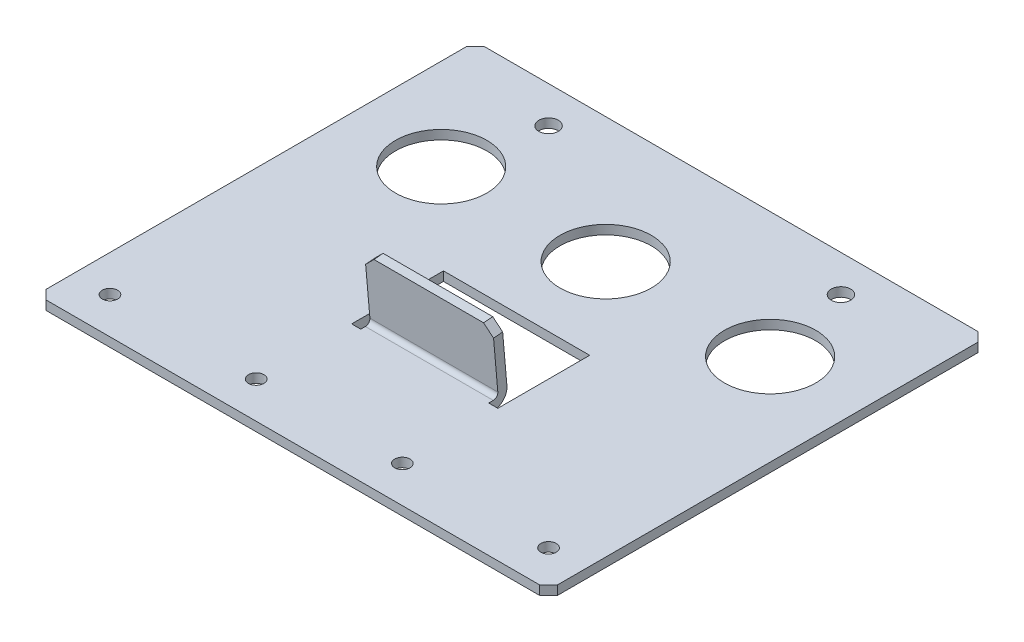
ISO-10303-21;
HEADER;
FILE_DESCRIPTION(('STEP AP214'),'2;1');
FILE_NAME('part.step','',(''),(''),'','','');
FILE_SCHEMA(('AUTOMOTIVE_DESIGN { 1 0 10303 214 1 1 1 1 }'));
ENDSEC;
DATA;
#1=APPLICATION_CONTEXT('core data for automotive mechanical design processes');
#2=APPLICATION_PROTOCOL_DEFINITION('international standard','automotive_design',2000,#1);
#3=PRODUCT_CONTEXT('',#1,'mechanical');
#4=PRODUCT('Part','Part','',(#3));
#5=PRODUCT_RELATED_PRODUCT_CATEGORY('part','',(#4));
#6=PRODUCT_DEFINITION_FORMATION('','',#4);
#7=PRODUCT_DEFINITION_CONTEXT('part definition',#1,'design');
#8=PRODUCT_DEFINITION('design','',#6,#7);
#9=PRODUCT_DEFINITION_SHAPE('','',#8);
#10=(LENGTH_UNIT() NAMED_UNIT(*) SI_UNIT(.MILLI.,.METRE.));
#11=(NAMED_UNIT(*) PLANE_ANGLE_UNIT() SI_UNIT($,.RADIAN.));
#12=(NAMED_UNIT(*) SI_UNIT($,.STERADIAN.) SOLID_ANGLE_UNIT());
#13=UNCERTAINTY_MEASURE_WITH_UNIT(LENGTH_MEASURE(1.E-05),#10,'distance_accuracy_value','');
#14=(GEOMETRIC_REPRESENTATION_CONTEXT(3) GLOBAL_UNCERTAINTY_ASSIGNED_CONTEXT((#13)) GLOBAL_UNIT_ASSIGNED_CONTEXT((#10,
#11,#12)) REPRESENTATION_CONTEXT('',''));
#15=CARTESIAN_POINT('',(0.,0.,0.));
#16=DIRECTION('',(0.,0.,1.));
#17=DIRECTION('',(1.,0.,0.));
#18=AXIS2_PLACEMENT_3D('',#15,#16,#17);
#19=CARTESIAN_POINT('',(0.,-3.175,0.));
#20=DIRECTION('',(0.,-1.,0.));
#21=DIRECTION('',(0.,0.,-1.));
#22=AXIS2_PLACEMENT_3D('',#19,#20,#21);
#23=PLANE('',#22);
#24=CARTESIAN_POINT('',(31.75,-3.175,-108.74375));
#25=DIRECTION('',(0.,1.,0.));
#26=DIRECTION('',(0.,0.,-1.));
#27=AXIS2_PLACEMENT_3D('',#24,#25,#26);
#28=CIRCLE('',#27,15.875);
#29=CARTESIAN_POINT('',(31.75,-3.175,-124.61875));
#30=VERTEX_POINT('',#29);
#31=EDGE_CURVE('E288',#30,#30,#28,.T.);
#32=ORIENTED_EDGE('',*,*,#31,.T.);
#33=EDGE_LOOP('',(#32));
#34=FACE_BOUND('',#33,.T.);
#35=CARTESIAN_POINT('',(146.05,-3.175,-108.74375));
#36=DIRECTION('',(0.,1.,0.));
#37=DIRECTION('',(0.,0.,1.));
#38=AXIS2_PLACEMENT_3D('',#35,#36,#37);
#39=CIRCLE('',#38,15.875);
#40=CARTESIAN_POINT('',(146.05,-3.175,-92.86875));
#41=VERTEX_POINT('',#40);
#42=EDGE_CURVE('E311',#41,#41,#39,.T.);
#43=ORIENTED_EDGE('',*,*,#42,.T.);
#44=EDGE_LOOP('',(#43));
#45=FACE_BOUND('',#44,.T.);
#46=CARTESIAN_POINT('',(88.9,-3.175,-108.74375));
#47=DIRECTION('',(0.,1.,0.));
#48=DIRECTION('',(0.,0.,1.));
#49=AXIS2_PLACEMENT_3D('',#46,#47,#48);
#50=CIRCLE('',#49,15.875);
#51=CARTESIAN_POINT('',(88.9,-3.175,-92.86875));
#52=VERTEX_POINT('',#51);
#53=EDGE_CURVE('E343',#52,#52,#50,.T.);
#54=ORIENTED_EDGE('',*,*,#53,.T.);
#55=EDGE_LOOP('',(#54));
#56=FACE_BOUND('',#55,.T.);
#57=DIRECTION('',(0.,0.,1.));
#58=VECTOR('',#57,1.);
#59=CARTESIAN_POINT('',(63.5,-3.175,0.));
#60=LINE('',#59,#58);
#61=CARTESIAN_POINT('',(63.5,-3.175,-77.7875));
#62=VERTEX_POINT('',#61);
#63=CARTESIAN_POINT('',(63.5,-3.175,-45.8804197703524));
#64=VERTEX_POINT('',#63);
#65=EDGE_CURVE('E423',#62,#64,#60,.T.);
#66=ORIENTED_EDGE('',*,*,#65,.T.);
#67=DIRECTION('',(1.,0.,0.));
#68=VECTOR('',#67,1.);
#69=CARTESIAN_POINT('',(0.,-3.175,-45.8804197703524));
#70=LINE('',#69,#68);
#71=CARTESIAN_POINT('',(66.675,-3.175,-45.8804197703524));
#72=VERTEX_POINT('',#71);
#73=EDGE_CURVE('E325',#64,#72,#70,.T.);
#74=ORIENTED_EDGE('',*,*,#73,.T.);
#75=DIRECTION('',(0.,0.,-1.));
#76=VECTOR('',#75,1.);
#77=CARTESIAN_POINT('',(66.675,-3.175,0.));
#78=LINE('',#77,#76);
#79=CARTESIAN_POINT('',(66.675,-3.175,-47.4679197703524));
#80=VERTEX_POINT('',#79);
#81=EDGE_CURVE('E484',#72,#80,#78,.T.);
#82=ORIENTED_EDGE('',*,*,#81,.T.);
#83=DIRECTION('',(1.,0.,0.));
#84=VECTOR('',#83,1.);
#85=CARTESIAN_POINT('',(66.675,-3.175,-47.4679197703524));
#86=LINE('',#85,#84);
#87=CARTESIAN_POINT('',(111.125,-3.175,-47.4679197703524));
#88=VERTEX_POINT('',#87);
#89=EDGE_CURVE('E431',#80,#88,#86,.T.);
#90=ORIENTED_EDGE('',*,*,#89,.T.);
#91=DIRECTION('',(0.,0.,1.));
#92=VECTOR('',#91,1.);
#93=CARTESIAN_POINT('',(111.125,-3.175,0.));
#94=LINE('',#93,#92);
#95=CARTESIAN_POINT('',(111.125,-3.175,-45.8804197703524));
#96=VERTEX_POINT('',#95);
#97=EDGE_CURVE('E469',#88,#96,#94,.T.);
#98=ORIENTED_EDGE('',*,*,#97,.T.);
#99=DIRECTION('',(1.,0.,0.));
#100=VECTOR('',#99,1.);
#101=CARTESIAN_POINT('',(0.,-3.175,-45.8804197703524));
#102=LINE('',#101,#100);
#103=CARTESIAN_POINT('',(114.3,-3.175,-45.8804197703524));
#104=VERTEX_POINT('',#103);
#105=EDGE_CURVE('E446',#96,#104,#102,.T.);
#106=ORIENTED_EDGE('',*,*,#105,.T.);
#107=DIRECTION('',(0.,0.,1.));
#108=VECTOR('',#107,1.);
#109=CARTESIAN_POINT('',(114.3,-3.175,0.));
#110=LINE('',#109,#108);
#111=CARTESIAN_POINT('',(114.3,-3.175,-77.7875));
#112=VERTEX_POINT('',#111);
#113=EDGE_CURVE('E509',#112,#104,#110,.T.);
#114=ORIENTED_EDGE('',*,*,#113,.F.);
#115=DIRECTION('',(1.,0.,0.));
#116=VECTOR('',#115,1.);
#117=CARTESIAN_POINT('',(0.,-3.175,-77.7875));
#118=LINE('',#117,#116);
#119=EDGE_CURVE('E315',#62,#112,#118,.T.);
#120=ORIENTED_EDGE('',*,*,#119,.F.);
#121=EDGE_LOOP('',(#66,#74,#82,#90,#98,#106,#114,#120));
#122=FACE_BOUND('',#121,.T.);
#123=CARTESIAN_POINT('',(114.3,-3.175,-12.7));
#124=DIRECTION('',(0.,1.,0.));
#125=DIRECTION('',(0.,0.,-1.));
#126=AXIS2_PLACEMENT_3D('',#123,#124,#125);
#127=CIRCLE('',#126,2.667);
#128=CARTESIAN_POINT('',(114.3,-3.175,-15.367));
#129=VERTEX_POINT('',#128);
#130=EDGE_CURVE('E396',#129,#129,#127,.T.);
#131=ORIENTED_EDGE('',*,*,#130,.T.);
#132=EDGE_LOOP('',(#131));
#133=FACE_BOUND('',#132,.T.);
#134=CARTESIAN_POINT('',(63.5,-3.175,-12.7));
#135=DIRECTION('',(0.,1.,0.));
#136=DIRECTION('',(0.,0.,1.));
#137=AXIS2_PLACEMENT_3D('',#134,#135,#136);
#138=CIRCLE('',#137,2.667);
#139=CARTESIAN_POINT('',(63.5,-3.175,-10.033));
#140=VERTEX_POINT('',#139);
#141=EDGE_CURVE('E395',#140,#140,#138,.T.);
#142=ORIENTED_EDGE('',*,*,#141,.T.);
#143=EDGE_LOOP('',(#142));
#144=FACE_BOUND('',#143,.T.);
#145=CARTESIAN_POINT('',(165.1,-3.175,-12.7));
#146=DIRECTION('',(0.,1.,0.));
#147=DIRECTION('',(0.,0.,-1.));
#148=AXIS2_PLACEMENT_3D('',#145,#146,#147);
#149=CIRCLE('',#148,2.667);
#150=CARTESIAN_POINT('',(165.1,-3.175,-15.367));
#151=VERTEX_POINT('',#150);
#152=EDGE_CURVE('E560',#151,#151,#149,.T.);
#153=ORIENTED_EDGE('',*,*,#152,.T.);
#154=EDGE_LOOP('',(#153));
#155=FACE_BOUND('',#154,.T.);
#156=CARTESIAN_POINT('',(12.7,-3.175,-12.7));
#157=DIRECTION('',(0.,1.,0.));
#158=DIRECTION('',(0.,0.,1.));
#159=AXIS2_PLACEMENT_3D('',#156,#157,#158);
#160=CIRCLE('',#159,2.667);
#161=CARTESIAN_POINT('',(12.7,-3.175,-10.033));
#162=VERTEX_POINT('',#161);
#163=EDGE_CURVE('E304',#162,#162,#160,.T.);
#164=ORIENTED_EDGE('',*,*,#163,.T.);
#165=EDGE_LOOP('',(#164));
#166=FACE_BOUND('',#165,.T.);
#167=CARTESIAN_POINT('',(139.7,-3.175,-139.7));
#168=DIRECTION('',(0.,1.,0.));
#169=DIRECTION('',(0.,0.,-1.));
#170=AXIS2_PLACEMENT_3D('',#167,#168,#169);
#171=CIRCLE('',#170,3.3782);
#172=CARTESIAN_POINT('',(139.7,-3.175,-143.0782));
#173=VERTEX_POINT('',#172);
#174=EDGE_CURVE('E303',#173,#173,#171,.T.);
#175=ORIENTED_EDGE('',*,*,#174,.T.);
#176=EDGE_LOOP('',(#175));
#177=FACE_BOUND('',#176,.T.);
#178=CARTESIAN_POINT('',(38.1,-3.175,-139.7));
#179=DIRECTION('',(0.,1.,0.));
#180=DIRECTION('',(0.,0.,1.));
#181=AXIS2_PLACEMENT_3D('',#178,#179,#180);
#182=CIRCLE('',#181,3.3782);
#183=CARTESIAN_POINT('',(38.1,-3.175,-136.3218));
#184=VERTEX_POINT('',#183);
#185=EDGE_CURVE('E35',#184,#184,#182,.T.);
#186=ORIENTED_EDGE('',*,*,#185,.T.);
#187=EDGE_LOOP('',(#186));
#188=FACE_BOUND('',#187,.T.);
#189=DIRECTION('',(0.,0.,1.));
#190=VECTOR('',#189,1.);
#191=CARTESIAN_POINT('',(0.,-3.175,0.));
#192=LINE('',#191,#190);
#193=CARTESIAN_POINT('',(0.,-3.175,-149.225));
#194=VERTEX_POINT('',#193);
#195=CARTESIAN_POINT('',(0.,-3.175,-3.175));
#196=VERTEX_POINT('',#195);
#197=EDGE_CURVE('E11',#194,#196,#192,.T.);
#198=ORIENTED_EDGE('',*,*,#197,.F.);
#199=DIRECTION('',(0.707106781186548,0.,-0.707106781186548));
#200=VECTOR('',#199,1.);
#201=CARTESIAN_POINT('',(-74.6125,-3.175,-74.6125));
#202=LINE('',#201,#200);
#203=CARTESIAN_POINT('',(3.175,-3.175,-152.4));
#204=VERTEX_POINT('',#203);
#205=EDGE_CURVE('E401',#194,#204,#202,.T.);
#206=ORIENTED_EDGE('',*,*,#205,.T.);
#207=DIRECTION('',(-1.,0.,0.));
#208=VECTOR('',#207,1.);
#209=CARTESIAN_POINT('',(0.,-3.175,-152.4));
#210=LINE('',#209,#208);
#211=CARTESIAN_POINT('',(174.625,-3.175,-152.4));
#212=VERTEX_POINT('',#211);
#213=EDGE_CURVE('E327',#212,#204,#210,.T.);
#214=ORIENTED_EDGE('',*,*,#213,.F.);
#215=DIRECTION('',(0.707106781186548,0.,0.707106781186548));
#216=VECTOR('',#215,1.);
#217=CARTESIAN_POINT('',(163.5125,-3.175,-163.5125));
#218=LINE('',#217,#216);
#219=CARTESIAN_POINT('',(177.8,-3.175,-149.225));
#220=VERTEX_POINT('',#219);
#221=EDGE_CURVE('E533',#212,#220,#218,.T.);
#222=ORIENTED_EDGE('',*,*,#221,.T.);
#223=DIRECTION('',(0.,0.,-1.));
#224=VECTOR('',#223,1.);
#225=CARTESIAN_POINT('',(177.8,-3.175,0.));
#226=LINE('',#225,#224);
#227=CARTESIAN_POINT('',(177.8,-3.175,-3.175));
#228=VERTEX_POINT('',#227);
#229=EDGE_CURVE('E296',#228,#220,#226,.T.);
#230=ORIENTED_EDGE('',*,*,#229,.F.);
#231=DIRECTION('',(-0.707106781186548,0.,0.707106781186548));
#232=VECTOR('',#231,1.);
#233=CARTESIAN_POINT('',(87.3125,-3.175,87.3125));
#234=LINE('',#233,#232);
#235=CARTESIAN_POINT('',(174.625,-3.175,0.));
#236=VERTEX_POINT('',#235);
#237=EDGE_CURVE('E417',#228,#236,#234,.T.);
#238=ORIENTED_EDGE('',*,*,#237,.T.);
#239=DIRECTION('',(1.,0.,0.));
#240=VECTOR('',#239,1.);
#241=CARTESIAN_POINT('',(0.,-3.175,0.));
#242=LINE('',#241,#240);
#243=CARTESIAN_POINT('',(3.175,-3.175,0.));
#244=VERTEX_POINT('',#243);
#245=EDGE_CURVE('E481',#244,#236,#242,.T.);
#246=ORIENTED_EDGE('',*,*,#245,.F.);
#247=DIRECTION('',(-0.707106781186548,0.,-0.707106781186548));
#248=VECTOR('',#247,1.);
#249=CARTESIAN_POINT('',(1.5875,-3.175,-1.5875));
#250=LINE('',#249,#248);
#251=EDGE_CURVE('E512',#244,#196,#250,.T.);
#252=ORIENTED_EDGE('',*,*,#251,.T.);
#253=EDGE_LOOP('',(#198,#206,#214,#222,#230,#238,#246,#252));
#254=FACE_BOUND('',#253,.T.);
#255=ADVANCED_FACE('F17',(#34,#45,#56,#122,#133,#144,#155,#166,#177,#188,#254),#23,.T.);
#256=CARTESIAN_POINT('',(0.,0.,0.));
#257=DIRECTION('',(0.,-1.,0.));
#258=DIRECTION('',(0.,0.,-1.));
#259=AXIS2_PLACEMENT_3D('',#256,#257,#258);
#260=PLANE('',#259);
#261=CARTESIAN_POINT('',(31.75,0.,-108.74375));
#262=DIRECTION('',(0.,1.,0.));
#263=DIRECTION('',(0.,0.,-1.));
#264=AXIS2_PLACEMENT_3D('',#261,#262,#263);
#265=CIRCLE('',#264,15.875);
#266=CARTESIAN_POINT('',(31.75,0.,-124.61875));
#267=VERTEX_POINT('',#266);
#268=EDGE_CURVE('E284',#267,#267,#265,.T.);
#269=ORIENTED_EDGE('',*,*,#268,.F.);
#270=EDGE_LOOP('',(#269));
#271=FACE_BOUND('',#270,.T.);
#272=CARTESIAN_POINT('',(146.05,0.,-108.74375));
#273=DIRECTION('',(0.,1.,0.));
#274=DIRECTION('',(0.,0.,1.));
#275=AXIS2_PLACEMENT_3D('',#272,#273,#274);
#276=CIRCLE('',#275,15.875);
#277=CARTESIAN_POINT('',(146.05,0.,-92.86875));
#278=VERTEX_POINT('',#277);
#279=EDGE_CURVE('E293',#278,#278,#276,.T.);
#280=ORIENTED_EDGE('',*,*,#279,.F.);
#281=EDGE_LOOP('',(#280));
#282=FACE_BOUND('',#281,.T.);
#283=CARTESIAN_POINT('',(88.9,0.,-108.74375));
#284=DIRECTION('',(0.,1.,0.));
#285=DIRECTION('',(0.,0.,1.));
#286=AXIS2_PLACEMENT_3D('',#283,#284,#285);
#287=CIRCLE('',#286,15.875);
#288=CARTESIAN_POINT('',(88.9,0.,-92.86875));
#289=VERTEX_POINT('',#288);
#290=EDGE_CURVE('E314',#289,#289,#287,.T.);
#291=ORIENTED_EDGE('',*,*,#290,.F.);
#292=EDGE_LOOP('',(#291));
#293=FACE_BOUND('',#292,.T.);
#294=CARTESIAN_POINT('',(114.3,0.,-12.7));
#295=DIRECTION('',(0.,1.,0.));
#296=DIRECTION('',(0.,0.,-1.));
#297=AXIS2_PLACEMENT_3D('',#294,#295,#296);
#298=CIRCLE('',#297,2.667);
#299=CARTESIAN_POINT('',(114.3,0.,-15.367));
#300=VERTEX_POINT('',#299);
#301=EDGE_CURVE('E474',#300,#300,#298,.T.);
#302=ORIENTED_EDGE('',*,*,#301,.F.);
#303=EDGE_LOOP('',(#302));
#304=FACE_BOUND('',#303,.T.);
#305=CARTESIAN_POINT('',(63.5,0.,-12.7));
#306=DIRECTION('',(0.,1.,0.));
#307=DIRECTION('',(0.,0.,1.));
#308=AXIS2_PLACEMENT_3D('',#305,#306,#307);
#309=CIRCLE('',#308,2.667);
#310=CARTESIAN_POINT('',(63.5,0.,-10.033));
#311=VERTEX_POINT('',#310);
#312=EDGE_CURVE('E392',#311,#311,#309,.T.);
#313=ORIENTED_EDGE('',*,*,#312,.F.);
#314=EDGE_LOOP('',(#313));
#315=FACE_BOUND('',#314,.T.);
#316=CARTESIAN_POINT('',(165.1,0.,-12.7));
#317=DIRECTION('',(0.,1.,0.));
#318=DIRECTION('',(0.,0.,-1.));
#319=AXIS2_PLACEMENT_3D('',#316,#317,#318);
#320=CIRCLE('',#319,2.667);
#321=CARTESIAN_POINT('',(165.1,0.,-15.367));
#322=VERTEX_POINT('',#321);
#323=EDGE_CURVE('E489',#322,#322,#320,.T.);
#324=ORIENTED_EDGE('',*,*,#323,.F.);
#325=EDGE_LOOP('',(#324));
#326=FACE_BOUND('',#325,.T.);
#327=CARTESIAN_POINT('',(12.7,0.,-12.7));
#328=DIRECTION('',(0.,1.,0.));
#329=DIRECTION('',(0.,0.,1.));
#330=AXIS2_PLACEMENT_3D('',#327,#328,#329);
#331=CIRCLE('',#330,2.667);
#332=CARTESIAN_POINT('',(12.7,0.,-10.033));
#333=VERTEX_POINT('',#332);
#334=EDGE_CURVE('E563',#333,#333,#331,.T.);
#335=ORIENTED_EDGE('',*,*,#334,.F.);
#336=EDGE_LOOP('',(#335));
#337=FACE_BOUND('',#336,.T.);
#338=CARTESIAN_POINT('',(139.7,0.,-139.7));
#339=DIRECTION('',(0.,1.,0.));
#340=DIRECTION('',(0.,0.,-1.));
#341=AXIS2_PLACEMENT_3D('',#338,#339,#340);
#342=CIRCLE('',#341,3.3782);
#343=CARTESIAN_POINT('',(139.7,0.,-143.0782));
#344=VERTEX_POINT('',#343);
#345=EDGE_CURVE('E300',#344,#344,#342,.T.);
#346=ORIENTED_EDGE('',*,*,#345,.F.);
#347=EDGE_LOOP('',(#346));
#348=FACE_BOUND('',#347,.T.);
#349=CARTESIAN_POINT('',(38.1,0.,-139.7));
#350=DIRECTION('',(0.,1.,0.));
#351=DIRECTION('',(0.,0.,1.));
#352=AXIS2_PLACEMENT_3D('',#349,#350,#351);
#353=CIRCLE('',#352,3.3782);
#354=CARTESIAN_POINT('',(38.1,0.,-136.3218));
#355=VERTEX_POINT('',#354);
#356=EDGE_CURVE('E42',#355,#355,#353,.T.);
#357=ORIENTED_EDGE('',*,*,#356,.F.);
#358=EDGE_LOOP('',(#357));
#359=FACE_BOUND('',#358,.T.);
#360=DIRECTION('',(-1.,0.,0.));
#361=VECTOR('',#360,1.);
#362=CARTESIAN_POINT('',(0.,0.,-152.4));
#363=LINE('',#362,#361);
#364=CARTESIAN_POINT('',(174.625,0.,-152.4));
#365=VERTEX_POINT('',#364);
#366=CARTESIAN_POINT('',(3.175,0.,-152.4));
#367=VERTEX_POINT('',#366);
#368=EDGE_CURVE('E330',#365,#367,#363,.T.);
#369=ORIENTED_EDGE('',*,*,#368,.T.);
#370=DIRECTION('',(-0.707106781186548,0.,0.707106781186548));
#371=VECTOR('',#370,1.);
#372=CARTESIAN_POINT('',(3.175,0.,-152.4));
#373=LINE('',#372,#371);
#374=CARTESIAN_POINT('',(0.,0.,-149.225));
#375=VERTEX_POINT('',#374);
#376=EDGE_CURVE('E475',#367,#375,#373,.T.);
#377=ORIENTED_EDGE('',*,*,#376,.T.);
#378=DIRECTION('',(0.,0.,1.));
#379=VECTOR('',#378,1.);
#380=CARTESIAN_POINT('',(0.,0.,0.));
#381=LINE('',#380,#379);
#382=CARTESIAN_POINT('',(0.,0.,-3.175));
#383=VERTEX_POINT('',#382);
#384=EDGE_CURVE('E25',#375,#383,#381,.T.);
#385=ORIENTED_EDGE('',*,*,#384,.T.);
#386=DIRECTION('',(0.707106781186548,0.,0.707106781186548));
#387=VECTOR('',#386,1.);
#388=CARTESIAN_POINT('',(0.,0.,-3.175));
#389=LINE('',#388,#387);
#390=CARTESIAN_POINT('',(3.175,0.,0.));
#391=VERTEX_POINT('',#390);
#392=EDGE_CURVE('E451',#383,#391,#389,.T.);
#393=ORIENTED_EDGE('',*,*,#392,.T.);
#394=DIRECTION('',(1.,0.,0.));
#395=VECTOR('',#394,1.);
#396=CARTESIAN_POINT('',(0.,0.,0.));
#397=LINE('',#396,#395);
#398=CARTESIAN_POINT('',(174.625,0.,0.));
#399=VERTEX_POINT('',#398);
#400=EDGE_CURVE('E299',#391,#399,#397,.T.);
#401=ORIENTED_EDGE('',*,*,#400,.T.);
#402=DIRECTION('',(0.707106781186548,0.,-0.707106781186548));
#403=VECTOR('',#402,1.);
#404=CARTESIAN_POINT('',(174.625,0.,0.));
#405=LINE('',#404,#403);
#406=CARTESIAN_POINT('',(177.8,0.,-3.175));
#407=VERTEX_POINT('',#406);
#408=EDGE_CURVE('E443',#399,#407,#405,.T.);
#409=ORIENTED_EDGE('',*,*,#408,.T.);
#410=DIRECTION('',(0.,0.,-1.));
#411=VECTOR('',#410,1.);
#412=CARTESIAN_POINT('',(177.8,0.,0.));
#413=LINE('',#412,#411);
#414=CARTESIAN_POINT('',(177.8,0.,-149.225));
#415=VERTEX_POINT('',#414);
#416=EDGE_CURVE('E298',#407,#415,#413,.T.);
#417=ORIENTED_EDGE('',*,*,#416,.T.);
#418=DIRECTION('',(-0.707106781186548,0.,-0.707106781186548));
#419=VECTOR('',#418,1.);
#420=CARTESIAN_POINT('',(177.8,0.,-149.225));
#421=LINE('',#420,#419);
#422=EDGE_CURVE('E541',#415,#365,#421,.T.);
#423=ORIENTED_EDGE('',*,*,#422,.T.);
#424=EDGE_LOOP('',(#369,#377,#385,#393,#401,#409,#417,#423));
#425=FACE_BOUND('',#424,.T.);
#426=DIRECTION('',(1.,0.,0.));
#427=VECTOR('',#426,1.);
#428=CARTESIAN_POINT('',(65.0875,0.,-45.8804197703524));
#429=LINE('',#428,#427);
#430=CARTESIAN_POINT('',(63.5,0.,-45.8804197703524));
#431=VERTEX_POINT('',#430);
#432=CARTESIAN_POINT('',(66.675,0.,-45.8804197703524));
#433=VERTEX_POINT('',#432);
#434=EDGE_CURVE('E324',#431,#433,#429,.T.);
#435=ORIENTED_EDGE('',*,*,#434,.F.);
#436=DIRECTION('',(0.,0.,1.));
#437=VECTOR('',#436,1.);
#438=CARTESIAN_POINT('',(63.5,0.,0.));
#439=LINE('',#438,#437);
#440=CARTESIAN_POINT('',(63.5,0.,-77.7875));
#441=VERTEX_POINT('',#440);
#442=EDGE_CURVE('E427',#441,#431,#439,.T.);
#443=ORIENTED_EDGE('',*,*,#442,.F.);
#444=DIRECTION('',(1.,0.,0.));
#445=VECTOR('',#444,1.);
#446=CARTESIAN_POINT('',(0.,0.,-77.7875));
#447=LINE('',#446,#445);
#448=CARTESIAN_POINT('',(114.3,0.,-77.7875));
#449=VERTEX_POINT('',#448);
#450=EDGE_CURVE('E497',#441,#449,#447,.T.);
#451=ORIENTED_EDGE('',*,*,#450,.T.);
#452=DIRECTION('',(0.,0.,1.));
#453=VECTOR('',#452,1.);
#454=CARTESIAN_POINT('',(114.3,0.,0.));
#455=LINE('',#454,#453);
#456=CARTESIAN_POINT('',(114.3,0.,-45.8804197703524));
#457=VERTEX_POINT('',#456);
#458=EDGE_CURVE('E426',#449,#457,#455,.T.);
#459=ORIENTED_EDGE('',*,*,#458,.T.);
#460=DIRECTION('',(1.,0.,0.));
#461=VECTOR('',#460,1.);
#462=CARTESIAN_POINT('',(111.125,0.,-45.8804197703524));
#463=LINE('',#462,#461);
#464=CARTESIAN_POINT('',(111.125,0.,-45.8804197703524));
#465=VERTEX_POINT('',#464);
#466=EDGE_CURVE('E459',#465,#457,#463,.T.);
#467=ORIENTED_EDGE('',*,*,#466,.F.);
#468=DIRECTION('',(0.,0.,1.));
#469=VECTOR('',#468,1.);
#470=CARTESIAN_POINT('',(111.125,0.,-47.4679197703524));
#471=LINE('',#470,#469);
#472=CARTESIAN_POINT('',(111.125,0.,-47.4679197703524));
#473=VERTEX_POINT('',#472);
#474=EDGE_CURVE('E478',#473,#465,#471,.T.);
#475=ORIENTED_EDGE('',*,*,#474,.F.);
#476=DIRECTION('',(1.,0.,0.));
#477=VECTOR('',#476,1.);
#478=CARTESIAN_POINT('',(66.675,0.,-47.4679197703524));
#479=LINE('',#478,#477);
#480=CARTESIAN_POINT('',(66.675,0.,-47.4679197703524));
#481=VERTEX_POINT('',#480);
#482=EDGE_CURVE('E409',#481,#473,#479,.T.);
#483=ORIENTED_EDGE('',*,*,#482,.F.);
#484=DIRECTION('',(0.,0.,-1.));
#485=VECTOR('',#484,1.);
#486=CARTESIAN_POINT('',(66.675,0.,-45.8804197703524));
#487=LINE('',#486,#485);
#488=EDGE_CURVE('E346',#433,#481,#487,.T.);
#489=ORIENTED_EDGE('',*,*,#488,.F.);
#490=EDGE_LOOP('',(#435,#443,#451,#459,#467,#475,#483,#489));
#491=FACE_BOUND('',#490,.T.);
#492=ADVANCED_FACE('F576',(#271,#282,#293,#304,#315,#326,#337,#348,#359,#425,#491),#260,.F.);
#493=CARTESIAN_POINT('',(0.,-3.175,0.));
#494=DIRECTION('',(-1.,0.,0.));
#495=DIRECTION('',(0.,0.,1.));
#496=AXIS2_PLACEMENT_3D('',#493,#494,#495);
#497=PLANE('',#496);
#498=ORIENTED_EDGE('',*,*,#384,.F.);
#499=DIRECTION('',(0.,-1.,0.));
#500=VECTOR('',#499,1.);
#501=CARTESIAN_POINT('',(0.,-3.175,-149.225));
#502=LINE('',#501,#500);
#503=EDGE_CURVE('E405',#375,#194,#502,.T.);
#504=ORIENTED_EDGE('',*,*,#503,.T.);
#505=ORIENTED_EDGE('',*,*,#197,.T.);
#506=DIRECTION('',(0.,1.,0.));
#507=VECTOR('',#506,1.);
#508=CARTESIAN_POINT('',(0.,-3.175,-3.175));
#509=LINE('',#508,#507);
#510=EDGE_CURVE('E422',#196,#383,#509,.T.);
#511=ORIENTED_EDGE('',*,*,#510,.T.);
#512=EDGE_LOOP('',(#498,#504,#505,#511));
#513=FACE_BOUND('',#512,.T.);
#514=ADVANCED_FACE('F584',(#513),#497,.T.);
#515=CARTESIAN_POINT('',(0.,-3.175,-152.4));
#516=DIRECTION('',(0.,0.,-1.));
#517=DIRECTION('',(0.,-1.,0.));
#518=AXIS2_PLACEMENT_3D('',#515,#516,#517);
#519=PLANE('',#518);
#520=ORIENTED_EDGE('',*,*,#213,.T.);
#521=DIRECTION('',(0.,1.,0.));
#522=VECTOR('',#521,1.);
#523=CARTESIAN_POINT('',(3.175,-3.175,-152.4));
#524=LINE('',#523,#522);
#525=EDGE_CURVE('E470',#204,#367,#524,.T.);
#526=ORIENTED_EDGE('',*,*,#525,.T.);
#527=ORIENTED_EDGE('',*,*,#368,.F.);
#528=DIRECTION('',(0.,-1.,0.));
#529=VECTOR('',#528,1.);
#530=CARTESIAN_POINT('',(174.625,-3.175,-152.4));
#531=LINE('',#530,#529);
#532=EDGE_CURVE('E537',#365,#212,#531,.T.);
#533=ORIENTED_EDGE('',*,*,#532,.T.);
#534=EDGE_LOOP('',(#520,#526,#527,#533));
#535=FACE_BOUND('',#534,.T.);
#536=ADVANCED_FACE('F606',(#535),#519,.T.);
#537=CARTESIAN_POINT('',(177.8,-3.175,0.));
#538=DIRECTION('',(1.,0.,0.));
#539=DIRECTION('',(0.,1.,0.));
#540=AXIS2_PLACEMENT_3D('',#537,#538,#539);
#541=PLANE('',#540);
#542=ORIENTED_EDGE('',*,*,#229,.T.);
#543=DIRECTION('',(0.,1.,0.));
#544=VECTOR('',#543,1.);
#545=CARTESIAN_POINT('',(177.8,-3.175,-149.225));
#546=LINE('',#545,#544);
#547=EDGE_CURVE('E406',#220,#415,#546,.T.);
#548=ORIENTED_EDGE('',*,*,#547,.T.);
#549=ORIENTED_EDGE('',*,*,#416,.F.);
#550=DIRECTION('',(0.,-1.,0.));
#551=VECTOR('',#550,1.);
#552=CARTESIAN_POINT('',(177.8,-3.175,-3.175));
#553=LINE('',#552,#551);
#554=EDGE_CURVE('E421',#407,#228,#553,.T.);
#555=ORIENTED_EDGE('',*,*,#554,.T.);
#556=EDGE_LOOP('',(#542,#548,#549,#555));
#557=FACE_BOUND('',#556,.T.);
#558=ADVANCED_FACE('F597',(#557),#541,.T.);
#559=CARTESIAN_POINT('',(0.,-3.175,0.));
#560=DIRECTION('',(0.,0.,1.));
#561=DIRECTION('',(1.,0.,0.));
#562=AXIS2_PLACEMENT_3D('',#559,#560,#561);
#563=PLANE('',#562);
#564=ORIENTED_EDGE('',*,*,#245,.T.);
#565=DIRECTION('',(0.,1.,0.));
#566=VECTOR('',#565,1.);
#567=CARTESIAN_POINT('',(174.625,-3.175,0.));
#568=LINE('',#567,#566);
#569=EDGE_CURVE('E529',#236,#399,#568,.T.);
#570=ORIENTED_EDGE('',*,*,#569,.T.);
#571=ORIENTED_EDGE('',*,*,#400,.F.);
#572=DIRECTION('',(0.,-1.,0.));
#573=VECTOR('',#572,1.);
#574=CARTESIAN_POINT('',(3.175,-3.175,0.));
#575=LINE('',#574,#573);
#576=EDGE_CURVE('E455',#391,#244,#575,.T.);
#577=ORIENTED_EDGE('',*,*,#576,.T.);
#578=EDGE_LOOP('',(#564,#570,#571,#577));
#579=FACE_BOUND('',#578,.T.);
#580=ADVANCED_FACE('F589',(#579),#563,.T.);
#581=CARTESIAN_POINT('',(38.1,-3.175,-139.7));
#582=DIRECTION('',(0.,1.,0.));
#583=DIRECTION('',(0.,0.,1.));
#584=AXIS2_PLACEMENT_3D('',#581,#582,#583);
#585=CYLINDRICAL_SURFACE('',#584,3.3782);
#586=ORIENTED_EDGE('',*,*,#185,.F.);
#587=EDGE_LOOP('',(#586));
#588=FACE_BOUND('',#587,.T.);
#589=ORIENTED_EDGE('',*,*,#356,.T.);
#590=EDGE_LOOP('',(#589));
#591=FACE_BOUND('',#590,.T.);
#592=ADVANCED_FACE('F642',(#588,#591),#585,.F.);
#593=CARTESIAN_POINT('',(139.7,-3.175,-139.7));
#594=DIRECTION('',(0.,1.,0.));
#595=DIRECTION('',(0.,0.,1.));
#596=AXIS2_PLACEMENT_3D('',#593,#594,#595);
#597=CYLINDRICAL_SURFACE('',#596,3.3782);
#598=ORIENTED_EDGE('',*,*,#174,.F.);
#599=EDGE_LOOP('',(#598));
#600=FACE_BOUND('',#599,.T.);
#601=ORIENTED_EDGE('',*,*,#345,.T.);
#602=EDGE_LOOP('',(#601));
#603=FACE_BOUND('',#602,.T.);
#604=ADVANCED_FACE('F638',(#600,#603),#597,.F.);
#605=CARTESIAN_POINT('',(12.7,-3.175,-12.7));
#606=DIRECTION('',(0.,1.,0.));
#607=DIRECTION('',(0.,0.,1.));
#608=AXIS2_PLACEMENT_3D('',#605,#606,#607);
#609=CYLINDRICAL_SURFACE('',#608,2.667);
#610=ORIENTED_EDGE('',*,*,#163,.F.);
#611=EDGE_LOOP('',(#610));
#612=FACE_BOUND('',#611,.T.);
#613=ORIENTED_EDGE('',*,*,#334,.T.);
#614=EDGE_LOOP('',(#613));
#615=FACE_BOUND('',#614,.T.);
#616=ADVANCED_FACE('F641',(#612,#615),#609,.F.);
#617=CARTESIAN_POINT('',(165.1,-3.175,-12.7));
#618=DIRECTION('',(0.,1.,0.));
#619=DIRECTION('',(0.,0.,1.));
#620=AXIS2_PLACEMENT_3D('',#617,#618,#619);
#621=CYLINDRICAL_SURFACE('',#620,2.667);
#622=ORIENTED_EDGE('',*,*,#152,.F.);
#623=EDGE_LOOP('',(#622));
#624=FACE_BOUND('',#623,.T.);
#625=ORIENTED_EDGE('',*,*,#323,.T.);
#626=EDGE_LOOP('',(#625));
#627=FACE_BOUND('',#626,.T.);
#628=ADVANCED_FACE('F652',(#624,#627),#621,.F.);
#629=CARTESIAN_POINT('',(63.5,-3.175,-12.7));
#630=DIRECTION('',(0.,1.,0.));
#631=DIRECTION('',(0.,0.,1.));
#632=AXIS2_PLACEMENT_3D('',#629,#630,#631);
#633=CYLINDRICAL_SURFACE('',#632,2.667);
#634=ORIENTED_EDGE('',*,*,#141,.F.);
#635=EDGE_LOOP('',(#634));
#636=FACE_BOUND('',#635,.T.);
#637=ORIENTED_EDGE('',*,*,#312,.T.);
#638=EDGE_LOOP('',(#637));
#639=FACE_BOUND('',#638,.T.);
#640=ADVANCED_FACE('F724',(#636,#639),#633,.F.);
#641=CARTESIAN_POINT('',(114.3,-3.175,-12.7));
#642=DIRECTION('',(0.,1.,0.));
#643=DIRECTION('',(0.,0.,1.));
#644=AXIS2_PLACEMENT_3D('',#641,#642,#643);
#645=CYLINDRICAL_SURFACE('',#644,2.667);
#646=ORIENTED_EDGE('',*,*,#130,.F.);
#647=EDGE_LOOP('',(#646));
#648=FACE_BOUND('',#647,.T.);
#649=ORIENTED_EDGE('',*,*,#301,.T.);
#650=EDGE_LOOP('',(#649));
#651=FACE_BOUND('',#650,.T.);
#652=ADVANCED_FACE('F732',(#648,#651),#645,.F.);
#653=CARTESIAN_POINT('',(3.175,-3.175,-152.4));
#654=DIRECTION('',(0.707106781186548,0.,0.707106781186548));
#655=DIRECTION('',(0.,-1.,0.));
#656=AXIS2_PLACEMENT_3D('',#653,#654,#655);
#657=PLANE('',#656);
#658=ORIENTED_EDGE('',*,*,#205,.F.);
#659=ORIENTED_EDGE('',*,*,#503,.F.);
#660=ORIENTED_EDGE('',*,*,#376,.F.);
#661=ORIENTED_EDGE('',*,*,#525,.F.);
#662=EDGE_LOOP('',(#658,#659,#660,#661));
#663=FACE_BOUND('',#662,.T.);
#664=ADVANCED_FACE('F609',(#663),#657,.F.);
#665=CARTESIAN_POINT('',(177.8,-3.175,-149.225));
#666=DIRECTION('',(-0.707106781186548,0.,0.707106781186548));
#667=DIRECTION('',(0.,1.,0.));
#668=AXIS2_PLACEMENT_3D('',#665,#666,#667);
#669=PLANE('',#668);
#670=ORIENTED_EDGE('',*,*,#221,.F.);
#671=ORIENTED_EDGE('',*,*,#532,.F.);
#672=ORIENTED_EDGE('',*,*,#422,.F.);
#673=ORIENTED_EDGE('',*,*,#547,.F.);
#674=EDGE_LOOP('',(#670,#671,#672,#673));
#675=FACE_BOUND('',#674,.T.);
#676=ADVANCED_FACE('F603',(#675),#669,.F.);
#677=CARTESIAN_POINT('',(174.625,-3.175,0.));
#678=DIRECTION('',(-0.707106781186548,0.,-0.707106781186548));
#679=DIRECTION('',(-0.707106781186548,0.,0.707106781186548));
#680=AXIS2_PLACEMENT_3D('',#677,#678,#679);
#681=PLANE('',#680);
#682=ORIENTED_EDGE('',*,*,#237,.F.);
#683=ORIENTED_EDGE('',*,*,#554,.F.);
#684=ORIENTED_EDGE('',*,*,#408,.F.);
#685=ORIENTED_EDGE('',*,*,#569,.F.);
#686=EDGE_LOOP('',(#682,#683,#684,#685));
#687=FACE_BOUND('',#686,.T.);
#688=ADVANCED_FACE('F595',(#687),#681,.F.);
#689=CARTESIAN_POINT('',(0.,-3.175,-3.175));
#690=DIRECTION('',(0.707106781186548,0.,-0.707106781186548));
#691=DIRECTION('',(0.,-1.,0.));
#692=AXIS2_PLACEMENT_3D('',#689,#690,#691);
#693=PLANE('',#692);
#694=ORIENTED_EDGE('',*,*,#251,.F.);
#695=ORIENTED_EDGE('',*,*,#576,.F.);
#696=ORIENTED_EDGE('',*,*,#392,.F.);
#697=ORIENTED_EDGE('',*,*,#510,.F.);
#698=EDGE_LOOP('',(#694,#695,#696,#697));
#699=FACE_BOUND('',#698,.T.);
#700=ADVANCED_FACE('F587',(#699),#693,.F.);
#701=CARTESIAN_POINT('',(114.3,-3.175,0.));
#702=DIRECTION('',(-1.,0.,0.));
#703=DIRECTION('',(0.,0.,1.));
#704=AXIS2_PLACEMENT_3D('',#701,#702,#703);
#705=PLANE('',#704);
#706=ORIENTED_EDGE('',*,*,#458,.F.);
#707=DIRECTION('',(0.,1.,0.));
#708=VECTOR('',#707,1.);
#709=CARTESIAN_POINT('',(114.3,-3.175,-77.7875));
#710=LINE('',#709,#708);
#711=EDGE_CURVE('E319',#112,#449,#710,.T.);
#712=ORIENTED_EDGE('',*,*,#711,.F.);
#713=ORIENTED_EDGE('',*,*,#113,.T.);
#714=DIRECTION('',(0.,1.,0.));
#715=VECTOR('',#714,1.);
#716=CARTESIAN_POINT('',(114.3,-3.175,-45.8804197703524));
#717=LINE('',#716,#715);
#718=EDGE_CURVE('E463',#104,#457,#717,.T.);
#719=ORIENTED_EDGE('',*,*,#718,.T.);
#720=EDGE_LOOP('',(#706,#712,#713,#719));
#721=FACE_BOUND('',#720,.T.);
#722=ADVANCED_FACE('F770',(#721),#705,.T.);
#723=CARTESIAN_POINT('',(63.5,-3.175,0.));
#724=DIRECTION('',(-1.,0.,0.));
#725=DIRECTION('',(0.,0.,1.));
#726=AXIS2_PLACEMENT_3D('',#723,#724,#725);
#727=PLANE('',#726);
#728=ORIENTED_EDGE('',*,*,#442,.T.);
#729=DIRECTION('',(0.,1.,0.));
#730=VECTOR('',#729,1.);
#731=CARTESIAN_POINT('',(63.5,-3.175,-45.8804197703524));
#732=LINE('',#731,#730);
#733=EDGE_CURVE('E321',#64,#431,#732,.T.);
#734=ORIENTED_EDGE('',*,*,#733,.F.);
#735=ORIENTED_EDGE('',*,*,#65,.F.);
#736=DIRECTION('',(0.,1.,0.));
#737=VECTOR('',#736,1.);
#738=CARTESIAN_POINT('',(63.5,-3.175,-77.7875));
#739=LINE('',#738,#737);
#740=EDGE_CURVE('E320',#62,#441,#739,.T.);
#741=ORIENTED_EDGE('',*,*,#740,.T.);
#742=EDGE_LOOP('',(#728,#734,#735,#741));
#743=FACE_BOUND('',#742,.T.);
#744=ADVANCED_FACE('F778',(#743),#727,.F.);
#745=CARTESIAN_POINT('',(0.,-3.175,-77.7875));
#746=DIRECTION('',(0.,0.,1.));
#747=DIRECTION('',(1.,0.,0.));
#748=AXIS2_PLACEMENT_3D('',#745,#746,#747);
#749=PLANE('',#748);
#750=ORIENTED_EDGE('',*,*,#450,.F.);
#751=ORIENTED_EDGE('',*,*,#740,.F.);
#752=ORIENTED_EDGE('',*,*,#119,.T.);
#753=ORIENTED_EDGE('',*,*,#711,.T.);
#754=EDGE_LOOP('',(#750,#751,#752,#753));
#755=FACE_BOUND('',#754,.T.);
#756=ADVANCED_FACE('F787',(#755),#749,.T.);
#757=CARTESIAN_POINT('',(65.0875,0.,-45.8804197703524));
#758=DIRECTION('',(0.,0.,-1.));
#759=DIRECTION('',(0.,-1.,0.));
#760=AXIS2_PLACEMENT_3D('',#757,#758,#759);
#761=PLANE('',#760);
#762=ORIENTED_EDGE('',*,*,#73,.F.);
#763=ORIENTED_EDGE('',*,*,#733,.T.);
#764=ORIENTED_EDGE('',*,*,#434,.T.);
#765=DIRECTION('',(0.,-1.,0.));
#766=VECTOR('',#765,1.);
#767=CARTESIAN_POINT('',(66.675,0.,-45.8804197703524));
#768=LINE('',#767,#766);
#769=EDGE_CURVE('E368',#433,#72,#768,.T.);
#770=ORIENTED_EDGE('',*,*,#769,.T.);
#771=EDGE_LOOP('',(#762,#763,#764,#770));
#772=FACE_BOUND('',#771,.T.);
#773=ADVANCED_FACE('F796',(#772),#761,.T.);
#774=CARTESIAN_POINT('',(66.675,22.1283453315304,-50.4515206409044));
#775=DIRECTION('',(1.,0.,0.));
#776=DIRECTION('',(0.,1.,0.));
#777=AXIS2_PLACEMENT_3D('',#774,#775,#776);
#778=PLANE('',#777);
#779=ORIENTED_EDGE('',*,*,#81,.F.);
#780=ORIENTED_EDGE('',*,*,#769,.F.);
#781=ORIENTED_EDGE('',*,*,#488,.T.);
#782=CARTESIAN_POINT('',(66.675,1.5875,-47.4679197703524));
#783=DIRECTION('',(-1.,0.,0.));
#784=DIRECTION('',(0.,0.,1.));
#785=AXIS2_PLACEMENT_3D('',#782,#783,#784);
#786=CIRCLE('',#785,1.5875);
#787=CARTESIAN_POINT('',(66.675,1.7258597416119,-49.0493788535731));
#788=VERTEX_POINT('',#787);
#789=EDGE_CURVE('E416',#788,#481,#786,.T.);
#790=ORIENTED_EDGE('',*,*,#789,.F.);
#791=DIRECTION('',(0.,0.996194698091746,0.0871557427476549));
#792=VECTOR('',#791,1.);
#793=CARTESIAN_POINT('',(66.675,21.8516258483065,-47.2886024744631));
#794=LINE('',#793,#792);
#795=CARTESIAN_POINT('',(66.675,18.6887076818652,-47.5653219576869));
#796=VERTEX_POINT('',#795);
#797=EDGE_CURVE('E380',#788,#796,#794,.T.);
#798=ORIENTED_EDGE('',*,*,#797,.T.);
#799=DIRECTION('',(0.,0.0871557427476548,-0.996194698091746));
#800=VECTOR('',#799,1.);
#801=CARTESIAN_POINT('',(66.675,18.965427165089,-50.7282401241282));
#802=LINE('',#801,#800);
#803=CARTESIAN_POINT('',(66.675,18.965427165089,-50.7282401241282));
#804=VERTEX_POINT('',#803);
#805=EDGE_CURVE('E353',#796,#804,#802,.T.);
#806=ORIENTED_EDGE('',*,*,#805,.T.);
#807=DIRECTION('',(0.,0.996194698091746,0.0871557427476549));
#808=VECTOR('',#807,1.);
#809=CARTESIAN_POINT('',(66.675,4.82521643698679,-51.9653482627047));
#810=LINE('',#809,#808);
#811=CARTESIAN_POINT('',(66.675,2.00257922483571,-52.2122970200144));
#812=VERTEX_POINT('',#811);
#813=EDGE_CURVE('E400',#812,#804,#810,.T.);
#814=ORIENTED_EDGE('',*,*,#813,.F.);
#815=CARTESIAN_POINT('',(66.675,1.5875,-47.4679197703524));
#816=DIRECTION('',(-1.,0.,0.));
#817=DIRECTION('',(0.,0.,1.));
#818=AXIS2_PLACEMENT_3D('',#815,#816,#817);
#819=CIRCLE('',#818,4.7625);
#820=EDGE_CURVE('E435',#812,#80,#819,.T.);
#821=ORIENTED_EDGE('',*,*,#820,.T.);
#822=EDGE_LOOP('',(#779,#780,#781,#790,#798,#806,#814,#821));
#823=FACE_BOUND('',#822,.T.);
#824=ADVANCED_FACE('F805',(#823),#778,.F.);
#825=CARTESIAN_POINT('',(111.125,0.276719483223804,-52.3632901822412));
#826=DIRECTION('',(-1.,0.,0.));
#827=DIRECTION('',(0.,0.,1.));
#828=AXIS2_PLACEMENT_3D('',#825,#826,#827);
#829=PLANE('',#828);
#830=ORIENTED_EDGE('',*,*,#97,.F.);
#831=CARTESIAN_POINT('',(111.125,1.5875,-47.4679197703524));
#832=DIRECTION('',(1.,0.,0.));
#833=DIRECTION('',(0.,0.,1.));
#834=AXIS2_PLACEMENT_3D('',#831,#832,#833);
#835=CIRCLE('',#834,4.7625);
#836=CARTESIAN_POINT('',(111.125,2.00257922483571,-52.2122970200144));
#837=VERTEX_POINT('',#836);
#838=EDGE_CURVE('E439',#88,#837,#835,.T.);
#839=ORIENTED_EDGE('',*,*,#838,.T.);
#840=DIRECTION('',(0.,-0.996194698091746,-0.0871557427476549));
#841=VECTOR('',#840,1.);
#842=CARTESIAN_POINT('',(111.125,4.82521643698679,-51.9653482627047));
#843=LINE('',#842,#841);
#844=CARTESIAN_POINT('',(111.125,18.9654271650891,-50.7282401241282));
#845=VERTEX_POINT('',#844);
#846=EDGE_CURVE('E387',#845,#837,#843,.T.);
#847=ORIENTED_EDGE('',*,*,#846,.F.);
#848=DIRECTION('',(0.,-0.0871557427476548,0.996194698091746));
#849=VECTOR('',#848,1.);
#850=CARTESIAN_POINT('',(111.125,18.9654271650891,-50.7282401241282));
#851=LINE('',#850,#849);
#852=CARTESIAN_POINT('',(111.125,18.6887076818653,-47.5653219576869));
#853=VERTEX_POINT('',#852);
#854=EDGE_CURVE('E309',#845,#853,#851,.T.);
#855=ORIENTED_EDGE('',*,*,#854,.T.);
#856=DIRECTION('',(0.,-0.996194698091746,-0.0871557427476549));
#857=VECTOR('',#856,1.);
#858=CARTESIAN_POINT('',(111.125,0.,-49.2003720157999));
#859=LINE('',#858,#857);
#860=CARTESIAN_POINT('',(111.125,1.7258597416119,-49.0493788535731));
#861=VERTEX_POINT('',#860);
#862=EDGE_CURVE('E334',#853,#861,#859,.T.);
#863=ORIENTED_EDGE('',*,*,#862,.T.);
#864=CARTESIAN_POINT('',(111.125,1.5875,-47.4679197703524));
#865=DIRECTION('',(1.,0.,0.));
#866=DIRECTION('',(0.,0.,1.));
#867=AXIS2_PLACEMENT_3D('',#864,#865,#866);
#868=CIRCLE('',#867,1.5875);
#869=EDGE_CURVE('E413',#473,#861,#868,.T.);
#870=ORIENTED_EDGE('',*,*,#869,.F.);
#871=ORIENTED_EDGE('',*,*,#474,.T.);
#872=DIRECTION('',(0.,-1.,0.));
#873=VECTOR('',#872,1.);
#874=CARTESIAN_POINT('',(111.125,0.,-45.8804197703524));
#875=LINE('',#874,#873);
#876=EDGE_CURVE('E450',#465,#96,#875,.T.);
#877=ORIENTED_EDGE('',*,*,#876,.T.);
#878=EDGE_LOOP('',(#830,#839,#847,#855,#863,#870,#871,#877));
#879=FACE_BOUND('',#878,.T.);
#880=ADVANCED_FACE('F814',(#879),#829,.F.);
#881=CARTESIAN_POINT('',(65.0875,0.,-45.8804197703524));
#882=DIRECTION('',(0.,0.,-1.));
#883=DIRECTION('',(0.,-1.,0.));
#884=AXIS2_PLACEMENT_3D('',#881,#882,#883);
#885=PLANE('',#884);
#886=ORIENTED_EDGE('',*,*,#105,.F.);
#887=ORIENTED_EDGE('',*,*,#876,.F.);
#888=ORIENTED_EDGE('',*,*,#466,.T.);
#889=ORIENTED_EDGE('',*,*,#718,.F.);
#890=EDGE_LOOP('',(#886,#887,#888,#889));
#891=FACE_BOUND('',#890,.T.);
#892=ADVANCED_FACE('F823',(#891),#885,.T.);
#893=CARTESIAN_POINT('',(66.675,1.5875,-47.4679197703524));
#894=DIRECTION('',(-1.,0.,0.));
#895=DIRECTION('',(0.,0.087155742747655,-0.996194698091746));
#896=AXIS2_PLACEMENT_3D('',#893,#894,#895);
#897=CYLINDRICAL_SURFACE('',#896,4.7625);
#898=ORIENTED_EDGE('',*,*,#89,.F.);
#899=ORIENTED_EDGE('',*,*,#820,.F.);
#900=DIRECTION('',(1.,0.,0.));
#901=VECTOR('',#900,1.);
#902=CARTESIAN_POINT('',(111.125,2.00257922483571,-52.2122970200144));
#903=LINE('',#902,#901);
#904=EDGE_CURVE('E391',#812,#837,#903,.T.);
#905=ORIENTED_EDGE('',*,*,#904,.T.);
#906=ORIENTED_EDGE('',*,*,#838,.F.);
#907=EDGE_LOOP('',(#898,#899,#905,#906));
#908=FACE_BOUND('',#907,.T.);
#909=ADVANCED_FACE('F832',(#908),#897,.T.);
#910=CARTESIAN_POINT('',(66.675,1.5875,-47.4679197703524));
#911=DIRECTION('',(-1.,0.,0.));
#912=DIRECTION('',(0.,0.0871557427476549,-0.996194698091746));
#913=AXIS2_PLACEMENT_3D('',#910,#911,#912);
#914=CYLINDRICAL_SURFACE('',#913,1.5875);
#915=ORIENTED_EDGE('',*,*,#482,.T.);
#916=ORIENTED_EDGE('',*,*,#869,.T.);
#917=DIRECTION('',(-1.,0.,0.));
#918=VECTOR('',#917,1.);
#919=CARTESIAN_POINT('',(111.125,1.7258597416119,-49.0493788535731));
#920=LINE('',#919,#918);
#921=EDGE_CURVE('E383',#861,#788,#920,.T.);
#922=ORIENTED_EDGE('',*,*,#921,.T.);
#923=ORIENTED_EDGE('',*,*,#789,.T.);
#924=EDGE_LOOP('',(#915,#916,#922,#923));
#925=FACE_BOUND('',#924,.T.);
#926=ADVANCED_FACE('F841',(#925),#914,.F.);
#927=CARTESIAN_POINT('',(0.,4.82521643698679,-51.9653482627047));
#928=DIRECTION('',(0.,-0.0871557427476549,0.996194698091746));
#929=DIRECTION('',(-1.,0.,0.));
#930=AXIS2_PLACEMENT_3D('',#927,#928,#929);
#931=PLANE('',#930);
#932=DIRECTION('',(1.,0.,0.));
#933=VECTOR('',#932,1.);
#934=CARTESIAN_POINT('',(0.,22.1283453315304,-50.4515206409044));
#935=LINE('',#934,#933);
#936=CARTESIAN_POINT('',(69.85,22.1283453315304,-50.4515206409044));
#937=VERTEX_POINT('',#936);
#938=CARTESIAN_POINT('',(107.95,22.1283453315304,-50.4515206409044));
#939=VERTEX_POINT('',#938);
#940=EDGE_CURVE('E331',#937,#939,#935,.T.);
#941=ORIENTED_EDGE('',*,*,#940,.T.);
#942=DIRECTION('',(0.707106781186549,-0.704416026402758,-0.0616284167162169));
#943=VECTOR('',#942,1.);
#944=CARTESIAN_POINT('',(111.125,18.9654271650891,-50.7282401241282));
#945=LINE('',#944,#943);
#946=EDGE_CURVE('E358',#939,#845,#945,.T.);
#947=ORIENTED_EDGE('',*,*,#946,.T.);
#948=ORIENTED_EDGE('',*,*,#846,.T.);
#949=ORIENTED_EDGE('',*,*,#904,.F.);
#950=ORIENTED_EDGE('',*,*,#813,.T.);
#951=DIRECTION('',(0.707106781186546,0.704416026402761,0.0616284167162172));
#952=VECTOR('',#951,1.);
#953=CARTESIAN_POINT('',(69.85,22.1283453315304,-50.4515206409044));
#954=LINE('',#953,#952);
#955=EDGE_CURVE('E349',#804,#937,#954,.T.);
#956=ORIENTED_EDGE('',*,*,#955,.T.);
#957=EDGE_LOOP('',(#941,#947,#948,#949,#950,#956));
#958=FACE_BOUND('',#957,.T.);
#959=ADVANCED_FACE('F850',(#958),#931,.F.);
#960=CARTESIAN_POINT('',(0.,4.54849695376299,-48.8024300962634));
#961=DIRECTION('',(0.,-0.0871557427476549,0.996194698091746));
#962=DIRECTION('',(-1.,0.,0.));
#963=AXIS2_PLACEMENT_3D('',#960,#961,#962);
#964=PLANE('',#963);
#965=ORIENTED_EDGE('',*,*,#862,.F.);
#966=DIRECTION('',(-0.707106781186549,0.704416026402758,0.0616284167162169));
#967=VECTOR('',#966,1.);
#968=CARTESIAN_POINT('',(62.659612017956,66.9696702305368,-43.3412850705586));
#969=LINE('',#968,#967);
#970=CARTESIAN_POINT('',(107.95,21.8516258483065,-47.2886024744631));
#971=VERTEX_POINT('',#970);
#972=EDGE_CURVE('E305',#853,#971,#969,.T.);
#973=ORIENTED_EDGE('',*,*,#972,.T.);
#974=DIRECTION('',(1.,0.,0.));
#975=VECTOR('',#974,1.);
#976=CARTESIAN_POINT('',(111.125,21.8516258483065,-47.2886024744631));
#977=LINE('',#976,#975);
#978=CARTESIAN_POINT('',(69.85,21.8516258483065,-47.2886024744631));
#979=VERTEX_POINT('',#978);
#980=EDGE_CURVE('E335',#979,#971,#977,.T.);
#981=ORIENTED_EDGE('',*,*,#980,.F.);
#982=DIRECTION('',(-0.707106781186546,-0.704416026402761,-0.0616284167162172));
#983=VECTOR('',#982,1.);
#984=CARTESIAN_POINT('',(26.240387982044,-21.5920384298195,-51.0894306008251));
#985=LINE('',#984,#983);
#986=EDGE_CURVE('E357',#979,#796,#985,.T.);
#987=ORIENTED_EDGE('',*,*,#986,.T.);
#988=ORIENTED_EDGE('',*,*,#797,.F.);
#989=ORIENTED_EDGE('',*,*,#921,.F.);
#990=EDGE_LOOP('',(#965,#973,#981,#987,#988,#989));
#991=FACE_BOUND('',#990,.T.);
#992=ADVANCED_FACE('F859',(#991),#964,.T.);
#993=CARTESIAN_POINT('',(111.125,22.1283453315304,-50.4515206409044));
#994=DIRECTION('',(0.,-0.996194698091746,-0.0871557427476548));
#995=DIRECTION('',(0.,0.0871557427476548,-0.996194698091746));
#996=AXIS2_PLACEMENT_3D('',#993,#994,#995);
#997=PLANE('',#996);
#998=ORIENTED_EDGE('',*,*,#980,.T.);
#999=DIRECTION('',(0.,0.0871557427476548,-0.996194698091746));
#1000=VECTOR('',#999,1.);
#1001=CARTESIAN_POINT('',(107.95,22.1283453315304,-50.4515206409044));
#1002=LINE('',#1001,#1000);
#1003=EDGE_CURVE('E310',#971,#939,#1002,.T.);
#1004=ORIENTED_EDGE('',*,*,#1003,.T.);
#1005=ORIENTED_EDGE('',*,*,#940,.F.);
#1006=DIRECTION('',(0.,-0.0871557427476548,0.996194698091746));
#1007=VECTOR('',#1006,1.);
#1008=CARTESIAN_POINT('',(69.85,22.1283453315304,-50.4515206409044));
#1009=LINE('',#1008,#1007);
#1010=EDGE_CURVE('E362',#937,#979,#1009,.T.);
#1011=ORIENTED_EDGE('',*,*,#1010,.T.);
#1012=EDGE_LOOP('',(#998,#1004,#1005,#1011));
#1013=FACE_BOUND('',#1012,.T.);
#1014=ADVANCED_FACE('F868',(#1013),#997,.F.);
#1015=CARTESIAN_POINT('',(111.125,18.9654271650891,-50.7282401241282));
#1016=DIRECTION('',(-0.707106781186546,-0.70441602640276,-0.0616284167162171));
#1017=DIRECTION('',(-0.705757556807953,0.708453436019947,0.));
#1018=AXIS2_PLACEMENT_3D('',#1015,#1016,#1017);
#1019=PLANE('',#1018);
#1020=ORIENTED_EDGE('',*,*,#946,.F.);
#1021=ORIENTED_EDGE('',*,*,#1003,.F.);
#1022=ORIENTED_EDGE('',*,*,#972,.F.);
#1023=ORIENTED_EDGE('',*,*,#854,.F.);
#1024=EDGE_LOOP('',(#1020,#1021,#1022,#1023));
#1025=FACE_BOUND('',#1024,.T.);
#1026=ADVANCED_FACE('F877',(#1025),#1019,.F.);
#1027=CARTESIAN_POINT('',(69.85,22.1283453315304,-50.4515206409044));
#1028=DIRECTION('',(0.707106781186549,-0.704416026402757,-0.0616284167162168));
#1029=DIRECTION('',(0.,0.0871557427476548,-0.996194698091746));
#1030=AXIS2_PLACEMENT_3D('',#1027,#1028,#1029);
#1031=PLANE('',#1030);
#1032=ORIENTED_EDGE('',*,*,#955,.F.);
#1033=ORIENTED_EDGE('',*,*,#805,.F.);
#1034=ORIENTED_EDGE('',*,*,#986,.F.);
#1035=ORIENTED_EDGE('',*,*,#1010,.F.);
#1036=EDGE_LOOP('',(#1032,#1033,#1034,#1035));
#1037=FACE_BOUND('',#1036,.T.);
#1038=ADVANCED_FACE('F886',(#1037),#1031,.F.);
#1039=CARTESIAN_POINT('',(88.9,-3.175,-108.74375));
#1040=DIRECTION('',(0.,1.,0.));
#1041=DIRECTION('',(0.,0.,1.));
#1042=AXIS2_PLACEMENT_3D('',#1039,#1040,#1041);
#1043=CYLINDRICAL_SURFACE('',#1042,15.875);
#1044=ORIENTED_EDGE('',*,*,#53,.F.);
#1045=EDGE_LOOP('',(#1044));
#1046=FACE_BOUND('',#1045,.T.);
#1047=ORIENTED_EDGE('',*,*,#290,.T.);
#1048=EDGE_LOOP('',(#1047));
#1049=FACE_BOUND('',#1048,.T.);
#1050=ADVANCED_FACE('F895',(#1046,#1049),#1043,.F.);
#1051=CARTESIAN_POINT('',(146.05,-3.175,-108.74375));
#1052=DIRECTION('',(0.,1.,0.));
#1053=DIRECTION('',(0.,0.,1.));
#1054=AXIS2_PLACEMENT_3D('',#1051,#1052,#1053);
#1055=CYLINDRICAL_SURFACE('',#1054,15.875);
#1056=ORIENTED_EDGE('',*,*,#42,.F.);
#1057=EDGE_LOOP('',(#1056));
#1058=FACE_BOUND('',#1057,.T.);
#1059=ORIENTED_EDGE('',*,*,#279,.T.);
#1060=EDGE_LOOP('',(#1059));
#1061=FACE_BOUND('',#1060,.T.);
#1062=ADVANCED_FACE('F904',(#1058,#1061),#1055,.F.);
#1063=CARTESIAN_POINT('',(31.75,-3.175,-108.74375));
#1064=DIRECTION('',(0.,1.,0.));
#1065=DIRECTION('',(0.,0.,1.));
#1066=AXIS2_PLACEMENT_3D('',#1063,#1064,#1065);
#1067=CYLINDRICAL_SURFACE('',#1066,15.875);
#1068=ORIENTED_EDGE('',*,*,#31,.F.);
#1069=EDGE_LOOP('',(#1068));
#1070=FACE_BOUND('',#1069,.T.);
#1071=ORIENTED_EDGE('',*,*,#268,.T.);
#1072=EDGE_LOOP('',(#1071));
#1073=FACE_BOUND('',#1072,.T.);
#1074=ADVANCED_FACE('F285',(#1070,#1073),#1067,.F.);
#1075=CLOSED_SHELL('',(#255,#492,#514,#536,#558,#580,#592,#604,#616,#628,#640,#652,#664,#676,
#688,#700,#722,#744,#756,#773,#824,#880,#892,#909,#926,#959,#992,#1014,#1026,#1038,#1050,#1062,#1074));
#1076=MANIFOLD_SOLID_BREP('B1',#1075);
#1077=ADVANCED_BREP_SHAPE_REPRESENTATION('',(#18,#1076),#14);
#1078=SHAPE_DEFINITION_REPRESENTATION(#9,#1077);
ENDSEC;
END-ISO-10303-21;
